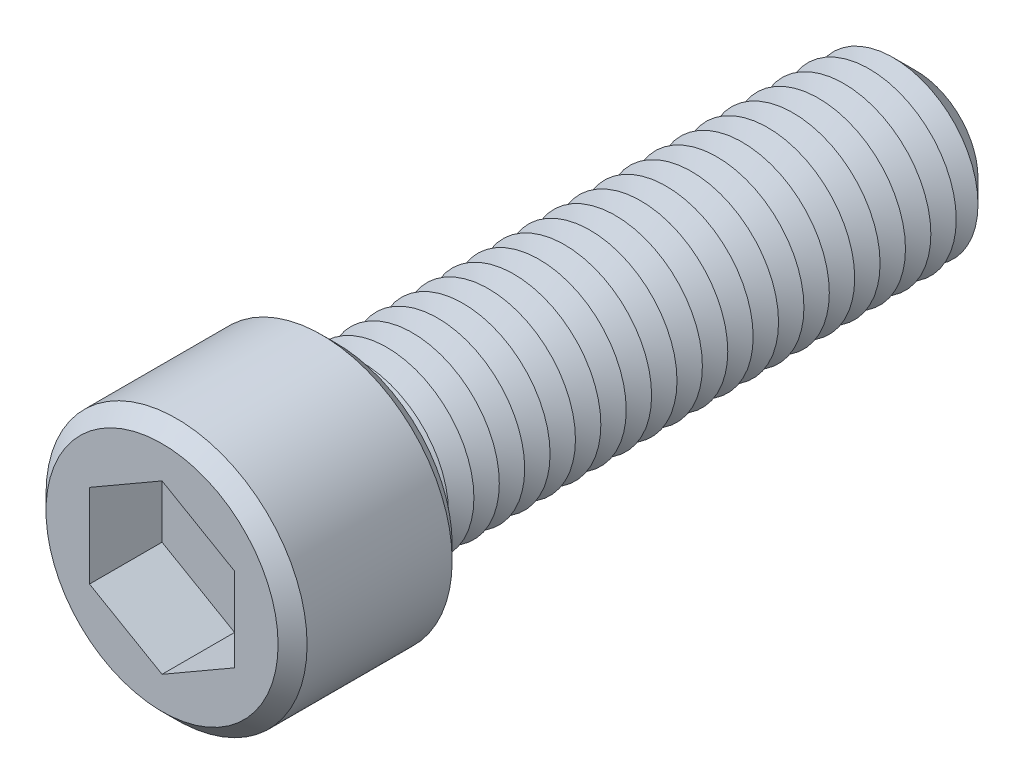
from build123d import *

# Parameters (mm, degrees)
SKETCH1_R           = 9
BOSS_EXTRUDE1_DEPTH = 12
SKETCH2_R           = 6
BOSS_EXTRUDE2_DEPTH = 40
CHAMFER1_SIZE       = 1.75
LPATTERN1_COUNT     = 22
LPATTERN1_PITCH     = 1.75
CUT_EXTRUDE1_DEPTH  = 5
SKETCH6_R           = 0.9
CUT_EXTRUDE2_DEPTH  = 47
CHAMFER2_SIZE       = 1


with BuildPart() as part:
    # Sketch1 → Boss-Extrude1 (new body)
    with BuildSketch(Plane.XY):
        Circle(SKETCH1_R)
    extrude(amount=BOSS_EXTRUDE1_DEPTH)

    # Sketch2 → Boss-Extrude2 (add)
    with BuildSketch(Plane(origin=(0, 0, 0), x_dir=(-1, 0, 0), z_dir=(0, 0, -1))):
        Circle(SKETCH2_R)
    extrude(amount=BOSS_EXTRUDE2_DEPTH)

    # Chamfer1
    chamfer1_edges = [part.edges().sort_by_distance(p)[0] for p in [
        (6, 0, -40),
    ]]
    chamfer(chamfer1_edges, length=CHAMFER1_SIZE)

    # Sketch4 → Cut-Revolve1 (revolve, cut)
    with BuildSketch(Plane(origin=(0, 0, 0), x_dir=(0, 0, -1), z_dir=(1, 0, 0)), mode=Mode.PRIVATE) as cut_revolve1_sk:
        Polygon((0, 6), (0.875, 4.484455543), (1.75, 6), align=None)
    cut_revolve1 = revolve(cut_revolve1_sk.sketch.rotate(Axis((0, 0, 2.512122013), (0, 0, -1)), 90), axis=Axis((0, 0, 2.512122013), (0, 0, -1)), mode=Mode.SUBTRACT)

    # LPattern1: Cut-Revolve1 ×22
    with Locations(*[(0, 0, -i * LPATTERN1_PITCH) for i in range(1, LPATTERN1_COUNT)]):
        add(cut_revolve1, mode=Mode.SUBTRACT)

    # Sketch5 → Cut-Extrude1 (cut)
    with BuildSketch(Plane.XY.offset(12)):
        Polygon((0, 5.773502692), (-5, 2.886751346), (-5, -2.886751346), (0, -5.773502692), (5, -2.886751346), (5, 2.886751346), align=None)
    extrude(amount=-CUT_EXTRUDE1_DEPTH, mode=Mode.SUBTRACT)

    # Sketch6 → Cut-Extrude2 (cut)
    with BuildSketch(Plane.XY.offset(7)):
        Circle(SKETCH6_R)
    extrude(amount=-CUT_EXTRUDE2_DEPTH, mode=Mode.SUBTRACT)

    # Chamfer2
    chamfer2_edges = [part.edges().sort_by_distance(p)[0] for p in [
        (-9, 0, 0),
        (-9, 0, 12),
    ]]
    chamfer(chamfer2_edges, length=CHAMFER2_SIZE)


solid = part.part
